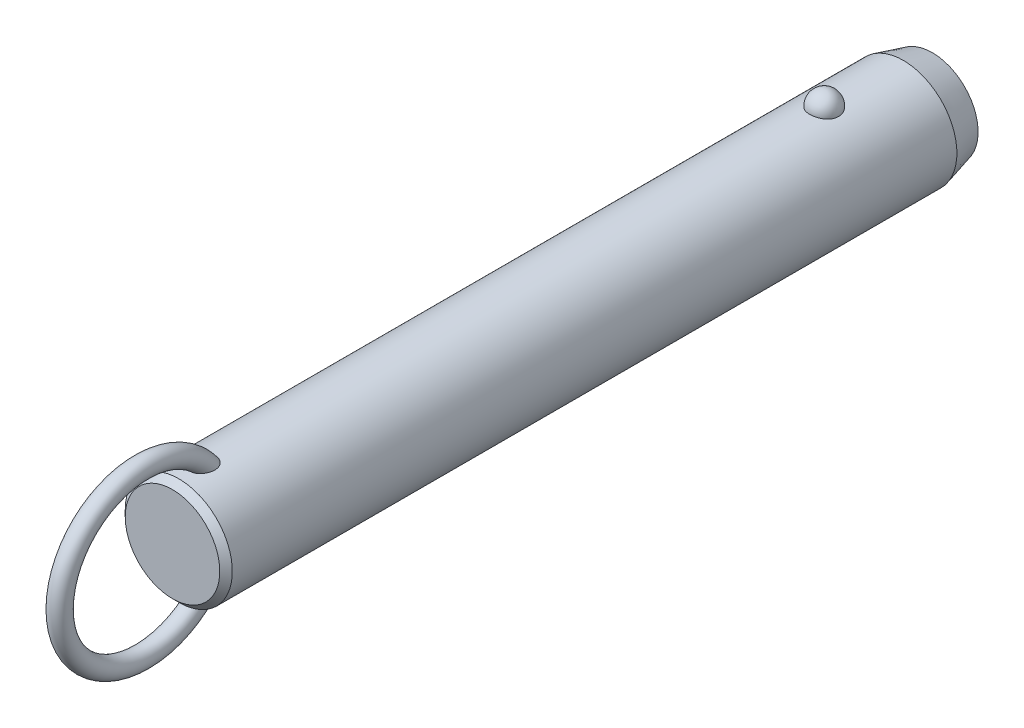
ISO-10303-21;
HEADER;
FILE_DESCRIPTION(('STEP AP214'),'2;1');
FILE_NAME('part.step','',(''),(''),'','','');
FILE_SCHEMA(('AUTOMOTIVE_DESIGN { 1 0 10303 214 1 1 1 1 }'));
ENDSEC;
DATA;
#1=APPLICATION_CONTEXT('core data for automotive mechanical design processes');
#2=APPLICATION_PROTOCOL_DEFINITION('international standard','automotive_design',2000,#1);
#3=PRODUCT_CONTEXT('',#1,'mechanical');
#4=PRODUCT('Part','Part','',(#3));
#5=PRODUCT_RELATED_PRODUCT_CATEGORY('part','',(#4));
#6=PRODUCT_DEFINITION_FORMATION('','',#4);
#7=PRODUCT_DEFINITION_CONTEXT('part definition',#1,'design');
#8=PRODUCT_DEFINITION('design','',#6,#7);
#9=PRODUCT_DEFINITION_SHAPE('','',#8);
#10=(LENGTH_UNIT() NAMED_UNIT(*) SI_UNIT(.MILLI.,.METRE.));
#11=(NAMED_UNIT(*) PLANE_ANGLE_UNIT() SI_UNIT($,.RADIAN.));
#12=(NAMED_UNIT(*) SI_UNIT($,.STERADIAN.) SOLID_ANGLE_UNIT());
#13=UNCERTAINTY_MEASURE_WITH_UNIT(LENGTH_MEASURE(1.E-05),#10,'distance_accuracy_value','');
#14=(GEOMETRIC_REPRESENTATION_CONTEXT(3) GLOBAL_UNCERTAINTY_ASSIGNED_CONTEXT((#13)) GLOBAL_UNIT_ASSIGNED_CONTEXT((#10,
#11,#12)) REPRESENTATION_CONTEXT('',''));
#15=CARTESIAN_POINT('',(0.,0.,0.));
#16=DIRECTION('',(0.,0.,1.));
#17=DIRECTION('',(1.,0.,0.));
#18=AXIS2_PLACEMENT_3D('',#15,#16,#17);
#19=CARTESIAN_POINT('',(0.,0.,119.4));
#20=DIRECTION('',(0.,0.,-1.));
#21=DIRECTION('',(-1.,0.,0.));
#22=AXIS2_PLACEMENT_3D('',#19,#20,#21);
#23=CYLINDRICAL_SURFACE('',#22,11.1);
#24=CARTESIAN_POINT('',(2.9724815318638,10.6945945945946,-3.));
#25=CARTESIAN_POINT('',(2.97247830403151,10.6945972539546,-2.83225059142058));
#26=CARTESIAN_POINT('',(2.95876598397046,10.6984356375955,-2.66445972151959));
#27=CARTESIAN_POINT('',(2.90424529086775,10.7133624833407,-2.33362381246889));
#28=CARTESIAN_POINT('',(2.8634252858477,10.7244540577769,-2.1705808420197));
#29=CARTESIAN_POINT('',(2.75573657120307,10.7526272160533,-1.85396767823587));
#30=CARTESIAN_POINT('',(2.68887937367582,10.7697061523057,-1.70039333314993));
#31=CARTESIAN_POINT('',(2.53079696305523,10.8079438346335,-1.40691598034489));
#32=CARTESIAN_POINT('',(2.43957264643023,10.8291024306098,-1.2670124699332));
#33=CARTESIAN_POINT('',(2.23458150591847,10.8732541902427,-1.00409565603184));
#34=CARTESIAN_POINT('',(2.12071295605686,10.8962553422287,-0.881162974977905));
#35=CARTESIAN_POINT('',(1.87365402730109,10.9414421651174,-0.656352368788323));
#36=CARTESIAN_POINT('',(1.74046358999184,10.9636278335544,-0.554474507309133));
#37=CARTESIAN_POINT('',(1.45872188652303,11.0046495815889,-0.374872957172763));
#38=CARTESIAN_POINT('',(1.31021276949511,11.0234944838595,-0.297085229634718));
#39=CARTESIAN_POINT('',(1.00170030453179,11.0557957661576,-0.167529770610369));
#40=CARTESIAN_POINT('',(0.841698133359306,11.0692526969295,-0.115759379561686));
#41=CARTESIAN_POINT('',(0.517607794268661,11.0890932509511,-0.0403925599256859));
#42=CARTESIAN_POINT('',(0.353633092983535,11.0955916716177,-0.0163383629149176));
#43=CARTESIAN_POINT('',(0.0238420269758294,11.1011989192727,0.0044517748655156));
#44=CARTESIAN_POINT('',(-0.141974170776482,11.1003084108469,0.00119017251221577));
#45=CARTESIAN_POINT('',(-0.468405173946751,11.0912990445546,-0.0323233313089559));
#46=CARTESIAN_POINT('',(-0.629059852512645,11.0832767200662,-0.0622147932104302));
#47=CARTESIAN_POINT('',(-0.942937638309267,11.0609962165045,-0.147645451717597));
#48=CARTESIAN_POINT('',(-1.09616062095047,11.0467379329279,-0.203185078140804));
#49=CARTESIAN_POINT('',(-1.39181061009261,11.0134071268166,-0.3387529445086));
#50=CARTESIAN_POINT('',(-1.53417383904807,10.9943086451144,-0.418913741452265));
#51=CARTESIAN_POINT('',(-1.80342160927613,10.9533667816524,-0.60144882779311));
#52=CARTESIAN_POINT('',(-1.9303046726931,10.9315231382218,-0.703825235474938));
#53=CARTESIAN_POINT('',(-2.16747598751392,10.887005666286,-0.930091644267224));
#54=CARTESIAN_POINT('',(-2.27742774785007,10.8643239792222,-1.05433291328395));
#55=CARTESIAN_POINT('',(-2.47517316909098,10.8209886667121,-1.31966633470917));
#56=CARTESIAN_POINT('',(-2.56296538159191,10.8003351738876,-1.46075958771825));
#57=CARTESIAN_POINT('',(-2.71500300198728,10.7631304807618,-1.75753646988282));
#58=CARTESIAN_POINT('',(-2.77898901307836,10.7466250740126,-1.91335887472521));
#59=CARTESIAN_POINT('',(-2.88046189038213,10.7198747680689,-2.2339152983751));
#60=CARTESIAN_POINT('',(-2.91794947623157,10.709629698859,-2.39864907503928));
#61=CARTESIAN_POINT('',(-2.96537819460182,10.6965949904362,-2.73165170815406));
#62=CARTESIAN_POINT('',(-2.97542891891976,10.693775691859,-2.89990378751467));
#63=CARTESIAN_POINT('',(-2.96804271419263,10.6958279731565,-3.235752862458));
#64=CARTESIAN_POINT('',(-2.95060646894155,10.7006993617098,-3.40334987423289));
#65=CARTESIAN_POINT('',(-2.88883358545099,10.71753912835,-3.73233906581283));
#66=CARTESIAN_POINT('',(-2.84462026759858,10.7294749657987,-3.89375610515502));
#67=CARTESIAN_POINT('',(-2.73050447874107,10.7590797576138,-4.20667949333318));
#68=CARTESIAN_POINT('',(-2.66060103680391,10.7767489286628,-4.35818546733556));
#69=CARTESIAN_POINT('',(-2.49642559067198,10.8159599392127,-4.6478542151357));
#70=CARTESIAN_POINT('',(-2.40203047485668,10.8375211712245,-4.78594458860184));
#71=CARTESIAN_POINT('',(-2.19143488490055,10.8820570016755,-5.0441038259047));
#72=CARTESIAN_POINT('',(-2.07523364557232,10.9050316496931,-5.16417205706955));
#73=CARTESIAN_POINT('',(-1.82361254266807,10.9499219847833,-5.38334833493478));
#74=CARTESIAN_POINT('',(-1.68812945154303,10.9718338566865,-5.48238464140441));
#75=CARTESIAN_POINT('',(-1.40191298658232,11.0120611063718,-5.65618873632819));
#76=CARTESIAN_POINT('',(-1.25118062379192,11.0303767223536,-5.73095813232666));
#77=CARTESIAN_POINT('',(-0.940570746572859,11.0611653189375,-5.85334725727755));
#78=CARTESIAN_POINT('',(-0.780821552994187,11.0737044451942,-5.90127578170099));
#79=CARTESIAN_POINT('',(-0.455204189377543,11.0918598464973,-5.96992976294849));
#80=CARTESIAN_POINT('',(-0.289336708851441,11.0974768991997,-5.99065827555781));
#81=CARTESIAN_POINT('',(0.0406846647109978,11.1011307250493,-6.00418773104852));
#82=CARTESIAN_POINT('',(0.204817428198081,11.099299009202,-5.99747318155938));
#83=CARTESIAN_POINT('',(0.5295530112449,11.088551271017,-5.9574031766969));
#84=CARTESIAN_POINT('',(0.69015594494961,11.0796354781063,-5.92404858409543));
#85=CARTESIAN_POINT('',(1.0027760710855,11.0557204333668,-5.83180084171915));
#86=CARTESIAN_POINT('',(1.15482001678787,11.0407414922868,-5.77299291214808));
#87=CARTESIAN_POINT('',(1.44678373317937,11.0062913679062,-5.63147366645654));
#88=CARTESIAN_POINT('',(1.58670279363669,10.9868199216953,-5.54876095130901));
#89=CARTESIAN_POINT('',(1.8527023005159,10.9451315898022,-5.36027644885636));
#90=CARTESIAN_POINT('',(1.97855158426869,10.9228788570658,-5.25418644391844));
#91=CARTESIAN_POINT('',(2.21080872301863,10.8782509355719,-5.02251354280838));
#92=CARTESIAN_POINT('',(2.31721312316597,10.8558757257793,-4.89692718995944));
#93=CARTESIAN_POINT('',(2.5094551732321,10.8130715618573,-4.62745408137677));
#94=CARTESIAN_POINT('',(2.59493284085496,10.7926798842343,-4.48330448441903));
#95=CARTESIAN_POINT('',(2.740862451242,10.7565495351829,-4.18236358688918));
#96=CARTESIAN_POINT('',(2.80132490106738,10.7408089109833,-4.02557762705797));
#97=CARTESIAN_POINT('',(2.88959070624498,10.7173718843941,-3.72475308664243));
#98=CARTESIAN_POINT('',(2.92062102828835,10.7088950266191,-3.58171216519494));
#99=CARTESIAN_POINT('',(2.96206765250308,10.6975052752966,-3.29245795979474));
#100=CARTESIAN_POINT('',(2.97248434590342,10.6945922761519,-3.14624473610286));
#101=CARTESIAN_POINT('',(2.9724815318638,10.6945945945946,-3.));
#102=B_SPLINE_CURVE_WITH_KNOTS('',3,(#24,#25,#26,#27,#28,#29,#30,#31,#32,#33,#34,#35,#36,#37,
#38,#39,#40,#41,#42,#43,#44,#45,#46,#47,#48,#49,#50,#51,#52,#53,#54,#55,#56,#57,#58,#59,#60,#61,
#62,#63,#64,#65,#66,#67,#68,#69,#70,#71,#72,#73,#74,#75,#76,#77,#78,#79,#80,#81,#82,#83,#84,#85,
#86,#87,#88,#89,#90,#91,#92,#93,#94,#95,#96,#97,#98,#99,#100,#101),.UNSPECIFIED.,.T.,.F.,(4,2,2,
2,2,2,2,2,2,2,2,2,2,2,2,2,2,2,2,2,2,2,2,2,2,2,2,2,2,2,2,2,2,2,2,2,2,2,4),(0.,0.502722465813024,
1.00566079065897,1.5083769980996,2.01107471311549,2.51608392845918,3.02109467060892,
3.52475118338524,4.02835620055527,4.523518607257,5.0186364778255,5.50715297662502,
5.9956776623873,6.48688002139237,6.97812923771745,7.47814366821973,7.9781907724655,
8.48353712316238,8.9888697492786,9.49218093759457,9.99547960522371,10.4964777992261,
10.997494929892,11.5010810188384,12.0046847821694,12.5099796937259,13.0152411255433,
13.5145635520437,14.0138298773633,14.5043200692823,14.9947943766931,15.4836390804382,
15.9725123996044,16.4685040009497,16.9645836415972,17.4686765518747,17.972557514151,
18.410841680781,18.849117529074),.UNSPECIFIED.);
#103=CARTESIAN_POINT('',(2.9724815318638,10.6945945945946,-3.));
#104=VERTEX_POINT('',#103);
#105=EDGE_CURVE('E41',#104,#104,#102,.T.);
#106=ORIENTED_EDGE('',*,*,#105,.T.);
#107=EDGE_LOOP('',(#106));
#108=FACE_BOUND('',#107,.T.);
#109=CARTESIAN_POINT('',(0.,0.,130.8));
#110=DIRECTION('',(0.,0.,1.));
#111=DIRECTION('',(1.,0.,0.));
#112=AXIS2_PLACEMENT_3D('',#109,#110,#111);
#113=CIRCLE('',#112,11.1);
#114=CARTESIAN_POINT('',(-11.1,0.,130.8));
#115=VERTEX_POINT('',#114);
#116=EDGE_CURVE('E10',#115,#115,#113,.F.);
#117=ORIENTED_EDGE('',*,*,#116,.T.);
#118=EDGE_LOOP('',(#117));
#119=FACE_BOUND('',#118,.T.);
#120=CARTESIAN_POINT('',(-0.564520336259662,-11.0856356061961,123.057815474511));
#121=CARTESIAN_POINT('',(-0.667202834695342,-11.0804062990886,123.091283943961));
#122=CARTESIAN_POINT('',(-0.766875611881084,-11.0738877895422,123.133835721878));
#123=CARTESIAN_POINT('',(-0.957284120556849,-11.0590576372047,123.235419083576));
#124=CARTESIAN_POINT('',(-1.04801616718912,-11.0507452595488,123.29445742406));
#125=CARTESIAN_POINT('',(-1.21800952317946,-11.0333016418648,123.426529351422));
#126=CARTESIAN_POINT('',(-1.29730805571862,-11.0241732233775,123.499515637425));
#127=CARTESIAN_POINT('',(-1.44337665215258,-11.0060026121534,123.657037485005));
#128=CARTESIAN_POINT('',(-1.51014622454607,-10.9969604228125,123.741573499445));
#129=CARTESIAN_POINT('',(-1.63454620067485,-10.9791841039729,123.925521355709));
#130=CARTESIAN_POINT('',(-1.69127003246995,-10.9705107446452,124.025549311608));
#131=CARTESIAN_POINT('',(-1.78980785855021,-10.9548648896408,124.232790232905));
#132=CARTESIAN_POINT('',(-1.83161214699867,-10.9478935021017,124.340007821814));
#133=CARTESIAN_POINT('',(-1.91557028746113,-10.9335803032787,124.605408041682));
#134=CARTESIAN_POINT('',(-1.95040620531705,-10.9273269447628,124.765980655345));
#135=CARTESIAN_POINT('',(-1.99388326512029,-10.9194709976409,125.090697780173));
#136=CARTESIAN_POINT('',(-2.00248051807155,-10.9178762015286,125.254847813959));
#137=CARTESIAN_POINT('',(-1.99551615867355,-10.9191578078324,125.624650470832));
#138=CARTESIAN_POINT('',(-1.9732206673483,-10.9232807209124,125.830191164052));
#139=CARTESIAN_POINT('',(-1.9152976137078,-10.9335244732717,126.133595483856));
#140=CARTESIAN_POINT('',(-1.89184575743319,-10.9376266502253,126.234088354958));
#141=CARTESIAN_POINT('',(-1.83700674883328,-10.9469720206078,126.432855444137));
#142=CARTESIAN_POINT('',(-1.80562070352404,-10.9522150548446,126.531129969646));
#143=CARTESIAN_POINT('',(-1.73463055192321,-10.9636837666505,126.725914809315));
#144=CARTESIAN_POINT('',(-1.69493416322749,-10.9699202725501,126.822390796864));
#145=CARTESIAN_POINT('',(-1.60745141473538,-10.9830806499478,127.011626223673));
#146=CARTESIAN_POINT('',(-1.55966150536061,-10.9900048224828,127.104384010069));
#147=CARTESIAN_POINT('',(-1.45591812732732,-11.0042280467,127.284690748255));
#148=CARTESIAN_POINT('',(-1.40000013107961,-11.0115253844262,127.372260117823));
#149=CARTESIAN_POINT('',(-1.27937470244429,-11.0261911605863,127.541029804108));
#150=CARTESIAN_POINT('',(-1.21467835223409,-11.0335594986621,127.62223795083));
#151=CARTESIAN_POINT('',(-1.08218150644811,-11.0473027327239,127.769001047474));
#152=CARTESIAN_POINT('',(-1.01522633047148,-11.0537063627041,127.835309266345));
#153=CARTESIAN_POINT('',(-0.872952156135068,-11.065850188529,127.958378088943));
#154=CARTESIAN_POINT('',(-0.797642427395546,-11.0715911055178,128.015149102));
#155=CARTESIAN_POINT('',(-0.651396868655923,-11.081071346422,128.107515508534));
#156=CARTESIAN_POINT('',(-0.581712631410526,-11.0849841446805,128.145049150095));
#157=CARTESIAN_POINT('',(-0.437066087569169,-11.0916271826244,128.208259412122));
#158=CARTESIAN_POINT('',(-0.362109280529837,-11.0943586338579,128.233948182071));
#159=CARTESIAN_POINT('',(-0.207828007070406,-11.0983242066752,128.271117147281));
#160=CARTESIAN_POINT('',(-0.128467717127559,-11.0995432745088,128.282454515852));
#161=CARTESIAN_POINT('',(0.0309101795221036,-11.1002423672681,128.288965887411));
#162=CARTESIAN_POINT('',(0.110927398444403,-11.0997233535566,128.284148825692));
#163=CARTESIAN_POINT('',(0.256406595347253,-11.097240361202,128.260959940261));
#164=CARTESIAN_POINT('',(0.322235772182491,-11.0955074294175,128.244754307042));
#165=CARTESIAN_POINT('',(0.450635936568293,-11.0910350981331,128.202600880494));
#166=CARTESIAN_POINT('',(0.513205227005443,-11.0882951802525,128.176648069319));
#167=CARTESIAN_POINT('',(0.662626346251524,-11.0805620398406,128.102607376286));
#168=CARTESIAN_POINT('',(0.747127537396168,-11.0751144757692,128.049845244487));
#169=CARTESIAN_POINT('',(0.906756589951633,-11.0631932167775,127.931720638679));
#170=CARTESIAN_POINT('',(0.981859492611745,-11.0567168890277,127.866325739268));
#171=CARTESIAN_POINT('',(1.10712207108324,-11.0447856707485,127.74226337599));
#172=CARTESIAN_POINT('',(1.15909566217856,-11.0394280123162,127.685383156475));
#173=CARTESIAN_POINT('',(1.25791923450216,-11.0286040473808,127.567327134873));
#174=CARTESIAN_POINT('',(1.30476642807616,-11.0231376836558,127.506149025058));
#175=CARTESIAN_POINT('',(1.43818612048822,-11.0068027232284,127.317305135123));
#176=CARTESIAN_POINT('',(1.51751767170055,-10.9960104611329,127.184453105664));
#177=CARTESIAN_POINT('',(1.63597546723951,-10.9788847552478,126.953137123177));
#178=CARTESIAN_POINT('',(1.67988876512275,-10.9722190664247,126.857053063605));
#179=CARTESIAN_POINT('',(1.7595324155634,-10.9597298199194,126.661431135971));
#180=CARTESIAN_POINT('',(1.79525967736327,-10.9539065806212,126.561891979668));
#181=CARTESIAN_POINT('',(1.8584473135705,-10.9433632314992,126.36021118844));
#182=CARTESIAN_POINT('',(1.88591073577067,-10.9386427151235,126.258070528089));
#183=CARTESIAN_POINT('',(1.93234324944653,-10.9305350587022,126.051819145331));
#184=CARTESIAN_POINT('',(1.95131065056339,-10.9271481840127,125.947708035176));
#185=CARTESIAN_POINT('',(1.99040203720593,-10.9201183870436,125.665458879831));
#186=CARTESIAN_POINT('',(2.00221217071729,-10.9179256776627,125.486037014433));
#187=CARTESIAN_POINT('',(1.99711676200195,-10.9188636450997,125.127713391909));
#188=CARTESIAN_POINT('',(1.98026150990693,-10.9219849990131,124.948811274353));
#189=CARTESIAN_POINT('',(1.92151657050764,-10.9324473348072,124.63645144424));
#190=CARTESIAN_POINT('',(1.88605081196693,-10.9386915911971,124.501759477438));
#191=CARTESIAN_POINT('',(1.79393020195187,-10.9541780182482,124.239966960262));
#192=CARTESIAN_POINT('',(1.73729868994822,-10.9634168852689,124.112858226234));
#193=CARTESIAN_POINT('',(1.61237037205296,-10.9824218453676,123.889418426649));
#194=CARTESIAN_POINT('',(1.54715374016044,-10.9918945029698,123.791345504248));
#195=CARTESIAN_POINT('',(1.40127026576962,-11.0114415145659,123.607434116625));
#196=CARTESIAN_POINT('',(1.3206074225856,-11.0215157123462,123.521592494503));
#197=CARTESIAN_POINT('',(1.1447478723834,-11.041168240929,123.365163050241));
#198=CARTESIAN_POINT('',(1.0494780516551,-11.0507437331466,123.294656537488));
#199=CARTESIAN_POINT('',(0.847278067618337,-11.0680789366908,123.172640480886));
#200=CARTESIAN_POINT('',(0.740351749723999,-11.0758392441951,123.121124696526));
#201=CARTESIAN_POINT('',(0.529289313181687,-11.0878275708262,123.043485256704));
#202=CARTESIAN_POINT('',(0.425895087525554,-11.0923259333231,123.015377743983));
#203=CARTESIAN_POINT('',(0.215723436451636,-11.0984001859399,122.977703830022));
#204=CARTESIAN_POINT('',(0.108947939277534,-11.0999777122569,122.968127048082));
#205=CARTESIAN_POINT('',(-0.0938962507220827,-11.1000196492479,122.967877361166));
#206=CARTESIAN_POINT('',(-0.189967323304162,-11.0987797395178,122.975408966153));
#207=CARTESIAN_POINT('',(-0.3796579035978,-11.0939111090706,123.005507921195));
#208=CARTESIAN_POINT('',(-0.473277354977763,-11.0902823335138,123.028075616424));
#209=CARTESIAN_POINT('',(-0.564520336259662,-11.0856356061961,123.057815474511));
#210=B_SPLINE_CURVE_WITH_KNOTS('',3,(#120,#121,#122,#123,#124,#125,#126,#127,#128,#129,#130,
#131,#132,#133,#134,#135,#136,#137,#138,#139,#140,#141,#142,#143,#144,#145,#146,#147,#148,#149,
#150,#151,#152,#153,#154,#155,#156,#157,#158,#159,#160,#161,#162,#163,#164,#165,#166,#167,#168,
#169,#170,#171,#172,#173,#174,#175,#176,#177,#178,#179,#180,#181,#182,#183,#184,#185,#186,#187,
#188,#189,#190,#191,#192,#193,#194,#195,#196,#197,#198,#199,#200,#201,#202,#203,#204,#205,#206,
#207,#208,#209),.UNSPECIFIED.,.T.,.F.,(4,2,2,2,2,2,2,2,2,2,2,2,2,2,2,2,2,2,2,2,2,2,2,2,2,2,2,2,
2,2,2,2,2,2,2,2,2,2,2,2,2,2,2,2,4),(0.,0.323999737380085,0.648132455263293,0.971184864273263,
1.2942499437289,1.6388623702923,1.98369857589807,2.4742605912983,2.96564271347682,
3.58257396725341,3.89215258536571,4.20168803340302,4.51486273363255,4.82817514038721,
5.14015911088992,5.4517528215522,5.73442856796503,6.01679375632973,6.25364580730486,
6.49025437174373,6.72919963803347,6.96801276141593,7.17061258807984,7.37331685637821,
7.67094989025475,7.96935728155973,8.20075067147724,8.43226927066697,8.89581623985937,
9.21306533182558,9.53043400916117,9.84768549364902,10.1650000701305,10.7022930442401,
11.2386443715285,11.6553390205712,12.0715755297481,12.4245637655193,12.7774607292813,
13.1321855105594,13.4867936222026,13.8068771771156,14.1267813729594,14.4146787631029,
14.7025827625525),.UNSPECIFIED.);
#211=CARTESIAN_POINT('',(-0.564520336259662,-11.0856356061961,123.057815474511));
#212=VERTEX_POINT('',#211);
#213=EDGE_CURVE('E59',#212,#212,#210,.T.);
#214=ORIENTED_EDGE('',*,*,#213,.T.);
#215=EDGE_LOOP('',(#214));
#216=FACE_BOUND('',#215,.T.);
#217=CARTESIAN_POINT('',(-0.564520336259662,11.0856356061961,123.057815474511));
#218=CARTESIAN_POINT('',(-0.468542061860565,11.0905203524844,123.026545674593));
#219=CARTESIAN_POINT('',(-0.369793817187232,11.0942886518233,123.003157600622));
#220=CARTESIAN_POINT('',(-0.169555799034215,11.0991586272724,122.973085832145));
#221=CARTESIAN_POINT('',(-0.0680604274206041,11.1002543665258,122.96643932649));
#222=CARTESIAN_POINT('',(0.134549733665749,11.099646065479,122.970157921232));
#223=CARTESIAN_POINT('',(0.235664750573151,11.0979441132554,122.98051033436));
#224=CARTESIAN_POINT('',(0.434632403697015,11.0919342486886,123.017831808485));
#225=CARTESIAN_POINT('',(0.532486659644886,11.0876276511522,123.044792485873));
#226=CARTESIAN_POINT('',(0.722445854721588,11.0768742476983,123.1144096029));
#227=CARTESIAN_POINT('',(0.814543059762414,11.0704246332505,123.157086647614));
#228=CARTESIAN_POINT('',(0.990565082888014,11.0560659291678,123.256648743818));
#229=CARTESIAN_POINT('',(1.07448844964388,11.048156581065,123.313536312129));
#230=CARTESIAN_POINT('',(1.23562672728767,11.0313221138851,123.442210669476));
#231=CARTESIAN_POINT('',(1.3124268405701,11.0223686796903,123.514511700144));
#232=CARTESIAN_POINT('',(1.45398030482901,11.0045918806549,123.670042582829));
#233=CARTESIAN_POINT('',(1.5187307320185,10.9957685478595,123.753275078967));
#234=CARTESIAN_POINT('',(1.64107232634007,10.9782087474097,123.936384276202));
#235=CARTESIAN_POINT('',(1.69743176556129,10.9695572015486,124.037089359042));
#236=CARTESIAN_POINT('',(1.79515063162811,10.9539887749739,124.245626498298));
#237=CARTESIAN_POINT('',(1.83649966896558,10.9470730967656,124.35346343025));
#238=CARTESIAN_POINT('',(1.91931148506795,10.9329211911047,124.620399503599));
#239=CARTESIAN_POINT('',(1.95340104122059,10.9267904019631,124.781861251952));
#240=CARTESIAN_POINT('',(1.99526195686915,10.9192174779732,125.10821631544));
#241=CARTESIAN_POINT('',(2.00298989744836,10.9177830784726,125.27311484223));
#242=CARTESIAN_POINT('',(1.99396251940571,10.9194420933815,125.644100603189));
#243=CARTESIAN_POINT('',(1.97050829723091,10.923774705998,125.85003871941));
#244=CARTESIAN_POINT('',(1.91079643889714,10.9343131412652,126.153901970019));
#245=CARTESIAN_POINT('',(1.88673702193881,10.9385106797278,126.254529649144));
#246=CARTESIAN_POINT('',(1.83065508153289,10.9480376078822,126.453510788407));
#247=CARTESIAN_POINT('',(1.79863369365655,10.9533668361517,126.551864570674));
#248=CARTESIAN_POINT('',(1.72633365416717,10.9649954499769,126.746720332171));
#249=CARTESIAN_POINT('',(1.68596409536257,10.9713053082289,126.84318790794));
#250=CARTESIAN_POINT('',(1.59707998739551,10.9845964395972,127.032323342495));
#251=CARTESIAN_POINT('',(1.54856169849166,10.9915780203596,127.124989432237));
#252=CARTESIAN_POINT('',(1.44330168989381,11.0058935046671,127.304975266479));
#253=CARTESIAN_POINT('',(1.3865974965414,11.0132257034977,127.392316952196));
#254=CARTESIAN_POINT('',(1.26431158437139,11.0279330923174,127.560456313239));
#255=CARTESIAN_POINT('',(1.19874160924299,11.0353082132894,127.641262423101));
#256=CARTESIAN_POINT('',(1.06542088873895,11.048931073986,127.785985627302));
#257=CARTESIAN_POINT('',(0.998640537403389,11.0552153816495,127.850784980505));
#258=CARTESIAN_POINT('',(0.85689668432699,11.0671032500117,127.970846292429));
#259=CARTESIAN_POINT('',(0.781942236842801,11.0727075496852,128.026118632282));
#260=CARTESIAN_POINT('',(0.636276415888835,11.081949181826,128.115972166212));
#261=CARTESIAN_POINT('',(0.566755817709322,11.0857572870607,128.152441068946));
#262=CARTESIAN_POINT('',(0.422602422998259,11.0921860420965,128.213533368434));
#263=CARTESIAN_POINT('',(0.347974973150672,11.0948079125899,128.238168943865));
#264=CARTESIAN_POINT('',(0.19459385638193,11.0985608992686,128.273323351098));
#265=CARTESIAN_POINT('',(0.115807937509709,11.0996777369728,128.283706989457));
#266=CARTESIAN_POINT('',(-0.0422499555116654,11.1002003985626,128.288574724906));
#267=CARTESIAN_POINT('',(-0.12152169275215,11.09960699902,128.283066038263));
#268=CARTESIAN_POINT('',(-0.266046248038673,11.0970123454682,128.258827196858));
#269=CARTESIAN_POINT('',(-0.331661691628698,11.0952283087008,128.242135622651));
#270=CARTESIAN_POINT('',(-0.459588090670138,11.0906663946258,128.199111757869));
#271=CARTESIAN_POINT('',(-0.521897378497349,11.0878880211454,128.172774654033));
#272=CARTESIAN_POINT('',(-0.671446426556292,11.0800342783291,128.097513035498));
#273=CARTESIAN_POINT('',(-0.756250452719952,11.0744969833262,128.043818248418));
#274=CARTESIAN_POINT('',(-0.916349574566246,11.0624045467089,127.923802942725));
#275=CARTESIAN_POINT('',(-0.991618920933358,11.0558467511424,127.857449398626));
#276=CARTESIAN_POINT('',(-1.11713140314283,11.0437783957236,127.731633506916));
#277=CARTESIAN_POINT('',(-1.16920539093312,11.0383619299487,127.673952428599));
#278=CARTESIAN_POINT('',(-1.26817476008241,11.02743010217,127.554280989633));
#279=CARTESIAN_POINT('',(-1.31506731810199,11.0219146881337,127.492288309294));
#280=CARTESIAN_POINT('',(-1.40399813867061,11.0109399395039,127.364784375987));
#281=CARTESIAN_POINT('',(-1.44602864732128,11.0054807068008,127.299267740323));
#282=CARTESIAN_POINT('',(-1.52538779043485,10.9947621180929,127.165422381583));
#283=CARTESIAN_POINT('',(-1.56271516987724,10.9895028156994,127.097092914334));
#284=CARTESIAN_POINT('',(-1.645379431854,10.9774790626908,126.933210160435));
#285=CARTESIAN_POINT('',(-1.68879497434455,10.9708503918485,126.8366735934));
#286=CARTESIAN_POINT('',(-1.7674073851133,10.9584602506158,126.640236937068));
#287=CARTESIAN_POINT('',(-1.80260120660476,10.95269910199,126.54033561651));
#288=CARTESIAN_POINT('',(-1.86468657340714,10.9423003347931,126.337966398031));
#289=CARTESIAN_POINT('',(-1.8915816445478,10.9376622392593,126.235499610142));
#290=CARTESIAN_POINT('',(-1.93682458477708,10.9297405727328,126.028642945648));
#291=CARTESIAN_POINT('',(-1.95517082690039,10.9264572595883,125.924252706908));
#292=CARTESIAN_POINT('',(-1.99232562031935,10.9197647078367,125.64262876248));
#293=CARTESIAN_POINT('',(-2.00294603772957,10.9177914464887,125.464185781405));
#294=CARTESIAN_POINT('',(-1.99566675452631,10.9191290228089,125.107996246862));
#295=CARTESIAN_POINT('',(-1.97781651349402,10.9224306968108,124.93024902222));
#296=CARTESIAN_POINT('',(-1.91747214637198,10.9331592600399,124.619792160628));
#297=CARTESIAN_POINT('',(-1.88131022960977,10.9395108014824,124.485825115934));
#298=CARTESIAN_POINT('',(-1.7879038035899,10.9551659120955,124.22559757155));
#299=CARTESIAN_POINT('',(-1.7306830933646,10.9644661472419,124.099328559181));
#300=CARTESIAN_POINT('',(-1.60475573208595,10.9835398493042,123.87741565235));
#301=CARTESIAN_POINT('',(-1.53908879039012,10.9930297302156,123.780026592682));
#302=CARTESIAN_POINT('',(-1.39238608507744,11.0125708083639,123.597525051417));
#303=CARTESIAN_POINT('',(-1.31135150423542,11.0226219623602,123.512411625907));
#304=CARTESIAN_POINT('',(-1.14382035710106,11.0411991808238,123.36529943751));
#305=CARTESIAN_POINT('',(-1.05858500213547,11.0497792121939,123.30186930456));
#306=CARTESIAN_POINT('',(-0.878723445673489,11.0655285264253,123.190250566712));
#307=CARTESIAN_POINT('',(-0.784123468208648,11.0727015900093,123.142020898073));
#308=CARTESIAN_POINT('',(-0.646163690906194,11.0812501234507,123.086023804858));
#309=CARTESIAN_POINT('',(-0.605595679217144,11.0835451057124,123.071197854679));
#310=CARTESIAN_POINT('',(-0.564520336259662,11.0856356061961,123.057815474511));
#311=B_SPLINE_CURVE_WITH_KNOTS('',3,(#217,#218,#219,#220,#221,#222,#223,#224,#225,#226,#227,
#228,#229,#230,#231,#232,#233,#234,#235,#236,#237,#238,#239,#240,#241,#242,#243,#244,#245,#246,
#247,#248,#249,#250,#251,#252,#253,#254,#255,#256,#257,#258,#259,#260,#261,#262,#263,#264,#265,
#266,#267,#268,#269,#270,#271,#272,#273,#274,#275,#276,#277,#278,#279,#280,#281,#282,#283,#284,
#285,#286,#287,#288,#289,#290,#291,#292,#293,#294,#295,#296,#297,#298,#299,#300,#301,#302,#303,
#304,#305,#306,#307,#308,#309,#310),.UNSPECIFIED.,.T.,.F.,(4,2,2,2,2,2,2,2,2,2,2,2,2,2,2,2,2,2,
2,2,2,2,2,2,2,2,2,2,2,2,2,2,2,2,2,2,2,2,2,2,2,2,2,2,2,2,4),(0.,0.303061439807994,
0.606795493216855,0.910302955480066,1.21365733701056,1.51741085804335,1.82121821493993,
2.13745205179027,2.45376252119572,2.79958678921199,3.14564996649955,3.63832391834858,
4.13180893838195,4.75031912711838,5.06071926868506,5.37107516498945,5.68500772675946,
5.99908475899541,6.31176519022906,6.62403542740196,6.90315673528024,7.18197194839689,
7.41687778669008,7.6515413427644,7.8884158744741,8.12518286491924,8.32752842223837,
8.52997509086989,8.82986421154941,9.13054668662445,9.36393502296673,9.5974499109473,
9.83133221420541,10.0652767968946,10.3830324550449,10.7009056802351,11.0186436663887,
11.3364420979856,11.8705925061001,12.4038159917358,12.8189662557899,13.2336487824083,
13.5857049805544,13.9377340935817,14.2561354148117,14.5736690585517,14.7033687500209),.UNSPECIFIED.);
#312=CARTESIAN_POINT('',(-0.564520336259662,11.0856356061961,123.057815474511));
#313=VERTEX_POINT('',#312);
#314=EDGE_CURVE('E67',#313,#313,#311,.T.);
#315=ORIENTED_EDGE('',*,*,#314,.T.);
#316=EDGE_LOOP('',(#315));
#317=FACE_BOUND('',#316,.T.);
#318=CARTESIAN_POINT('',(0.,0.,-19.3999999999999));
#319=DIRECTION('',(0.,0.,-1.));
#320=DIRECTION('',(-1.,0.,0.));
#321=AXIS2_PLACEMENT_3D('',#318,#319,#320);
#322=CIRCLE('',#321,11.1);
#323=CARTESIAN_POINT('',(-11.1,0.,-19.3999999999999));
#324=VERTEX_POINT('',#323);
#325=EDGE_CURVE('E56',#324,#324,#322,.F.);
#326=ORIENTED_EDGE('',*,*,#325,.T.);
#327=EDGE_LOOP('',(#326));
#328=FACE_BOUND('',#327,.T.);
#329=ADVANCED_FACE('F37',(#108,#119,#216,#317,#328),#23,.T.);
#330=CARTESIAN_POINT('',(0.,0.,-25.4));
#331=DIRECTION('',(0.,0.,-1.));
#332=DIRECTION('',(-1.,0.,0.));
#333=AXIS2_PLACEMENT_3D('',#330,#331,#332);
#334=PLANE('',#333);
#335=CARTESIAN_POINT('',(0.,0.,-25.4));
#336=DIRECTION('',(0.,0.,-1.));
#337=DIRECTION('',(-1.,0.,0.));
#338=AXIS2_PLACEMENT_3D('',#335,#336,#337);
#339=CIRCLE('',#338,9.49230484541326);
#340=CARTESIAN_POINT('',(-9.49230484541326,0.,-25.4));
#341=VERTEX_POINT('',#340);
#342=EDGE_CURVE('E66',#341,#341,#339,.T.);
#343=ORIENTED_EDGE('',*,*,#342,.T.);
#344=EDGE_LOOP('',(#343));
#345=FACE_BOUND('',#344,.T.);
#346=ADVANCED_FACE('F85',(#345),#334,.T.);
#347=CARTESIAN_POINT('',(0.,0.,-25.4));
#348=DIRECTION('',(0.,0.,1.));
#349=DIRECTION('',(1.,0.,0.));
#350=AXIS2_PLACEMENT_3D('',#347,#348,#349);
#351=CONICAL_SURFACE('',#350,9.49230484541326,0.261799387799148);
#352=ORIENTED_EDGE('',*,*,#325,.F.);
#353=EDGE_LOOP('',(#352));
#354=FACE_BOUND('',#353,.T.);
#355=ORIENTED_EDGE('',*,*,#342,.F.);
#356=EDGE_LOOP('',(#355));
#357=FACE_BOUND('',#356,.T.);
#358=ADVANCED_FACE('F83',(#354,#357),#351,.T.);
#359=CARTESIAN_POINT('',(0.,0.,132.1));
#360=DIRECTION('',(0.,0.,1.));
#361=DIRECTION('',(1.,0.,0.));
#362=AXIS2_PLACEMENT_3D('',#359,#360,#361);
#363=PLANE('',#362);
#364=CARTESIAN_POINT('',(0.,0.,132.1));
#365=DIRECTION('',(0.,0.,1.));
#366=DIRECTION('',(1.,0.,0.));
#367=AXIS2_PLACEMENT_3D('',#364,#365,#366);
#368=CIRCLE('',#367,9.8);
#369=CARTESIAN_POINT('',(-9.80000000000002,0.,132.1));
#370=VERTEX_POINT('',#369);
#371=EDGE_CURVE('E50',#370,#370,#368,.T.);
#372=ORIENTED_EDGE('',*,*,#371,.T.);
#373=EDGE_LOOP('',(#372));
#374=FACE_BOUND('',#373,.T.);
#375=ADVANCED_FACE('F77',(#374),#363,.T.);
#376=CARTESIAN_POINT('',(0.,0.,138.45));
#377=DIRECTION('',(1.,0.,0.));
#378=DIRECTION('',(0.,0.,-1.));
#379=AXIS2_PLACEMENT_3D('',#376,#377,#378);
#380=TOROIDAL_SURFACE('',#379,17.05,2.);
#381=ORIENTED_EDGE('',*,*,#314,.F.);
#382=EDGE_LOOP('',(#381));
#383=FACE_BOUND('',#382,.T.);
#384=ORIENTED_EDGE('',*,*,#213,.F.);
#385=EDGE_LOOP('',(#384));
#386=FACE_BOUND('',#385,.T.);
#387=ADVANCED_FACE('F73',(#383,#386),#380,.T.);
#388=CARTESIAN_POINT('',(0.,0.,132.1));
#389=DIRECTION('',(0.,0.,-1.));
#390=DIRECTION('',(-1.,0.,0.));
#391=AXIS2_PLACEMENT_3D('',#388,#389,#390);
#392=CONICAL_SURFACE('',#391,9.8,0.785398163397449);
#393=CARTESIAN_POINT('',(-11.1,0.,130.8));
#394=CARTESIAN_POINT('',(-11.0864583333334,0.,130.813541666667));
#395=CARTESIAN_POINT('',(-11.0729166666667,0.,130.827083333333));
#396=CARTESIAN_POINT('',(-11.0458333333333,0.,130.854166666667));
#397=CARTESIAN_POINT('',(-11.0322916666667,0.,130.867708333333));
#398=CARTESIAN_POINT('',(-11.0052083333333,0.,130.894791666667));
#399=CARTESIAN_POINT('',(-10.9916666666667,0.,130.908333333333));
#400=CARTESIAN_POINT('',(-10.9645833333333,0.,130.935416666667));
#401=CARTESIAN_POINT('',(-10.9510416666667,0.,130.948958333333));
#402=CARTESIAN_POINT('',(-10.9239583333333,0.,130.976041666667));
#403=CARTESIAN_POINT('',(-10.9104166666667,0.,130.989583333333));
#404=CARTESIAN_POINT('',(-10.8833333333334,0.,131.016666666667));
#405=CARTESIAN_POINT('',(-10.8697916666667,0.,131.030208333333));
#406=CARTESIAN_POINT('',(-10.8427083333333,0.,131.057291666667));
#407=CARTESIAN_POINT('',(-10.8291666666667,0.,131.070833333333));
#408=CARTESIAN_POINT('',(-10.8020833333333,0.,131.097916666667));
#409=CARTESIAN_POINT('',(-10.7885416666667,0.,131.111458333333));
#410=CARTESIAN_POINT('',(-10.7614583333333,0.,131.138541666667));
#411=CARTESIAN_POINT('',(-10.7479166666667,0.,131.152083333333));
#412=CARTESIAN_POINT('',(-10.7208333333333,0.,131.179166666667));
#413=CARTESIAN_POINT('',(-10.7072916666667,0.,131.192708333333));
#414=CARTESIAN_POINT('',(-10.6802083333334,0.,131.219791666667));
#415=CARTESIAN_POINT('',(-10.6666666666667,0.,131.233333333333));
#416=CARTESIAN_POINT('',(-10.6395833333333,0.,131.260416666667));
#417=CARTESIAN_POINT('',(-10.6260416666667,0.,131.273958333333));
#418=CARTESIAN_POINT('',(-10.5989583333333,0.,131.301041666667));
#419=CARTESIAN_POINT('',(-10.5854166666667,0.,131.314583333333));
#420=CARTESIAN_POINT('',(-10.5583333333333,0.,131.341666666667));
#421=CARTESIAN_POINT('',(-10.5447916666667,0.,131.355208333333));
#422=CARTESIAN_POINT('',(-10.5177083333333,0.,131.382291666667));
#423=CARTESIAN_POINT('',(-10.5041666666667,0.,131.395833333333));
#424=CARTESIAN_POINT('',(-10.4770833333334,0.,131.422916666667));
#425=CARTESIAN_POINT('',(-10.4635416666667,0.,131.436458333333));
#426=CARTESIAN_POINT('',(-10.4364583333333,0.,131.463541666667));
#427=CARTESIAN_POINT('',(-10.4229166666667,0.,131.477083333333));
#428=CARTESIAN_POINT('',(-10.3958333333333,0.,131.504166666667));
#429=CARTESIAN_POINT('',(-10.3822916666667,0.,131.517708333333));
#430=CARTESIAN_POINT('',(-10.3552083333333,0.,131.544791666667));
#431=CARTESIAN_POINT('',(-10.3416666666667,0.,131.558333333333));
#432=CARTESIAN_POINT('',(-10.3145833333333,0.,131.585416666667));
#433=CARTESIAN_POINT('',(-10.3010416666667,0.,131.598958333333));
#434=CARTESIAN_POINT('',(-10.2739583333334,0.,131.626041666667));
#435=CARTESIAN_POINT('',(-10.2604166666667,0.,131.639583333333));
#436=CARTESIAN_POINT('',(-10.2333333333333,0.,131.666666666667));
#437=CARTESIAN_POINT('',(-10.2197916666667,0.,131.680208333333));
#438=CARTESIAN_POINT('',(-10.1927083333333,0.,131.707291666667));
#439=CARTESIAN_POINT('',(-10.1791666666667,0.,131.720833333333));
#440=CARTESIAN_POINT('',(-10.1520833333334,0.,131.747916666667));
#441=CARTESIAN_POINT('',(-10.1385416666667,0.,131.761458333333));
#442=CARTESIAN_POINT('',(-10.1114583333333,0.,131.788541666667));
#443=CARTESIAN_POINT('',(-10.0979166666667,0.,131.802083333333));
#444=CARTESIAN_POINT('',(-10.0708333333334,0.,131.829166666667));
#445=CARTESIAN_POINT('',(-10.0572916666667,0.,131.842708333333));
#446=CARTESIAN_POINT('',(-10.0302083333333,0.,131.869791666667));
#447=CARTESIAN_POINT('',(-10.0166666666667,0.,131.883333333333));
#448=CARTESIAN_POINT('',(-9.98958333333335,0.,131.910416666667));
#449=CARTESIAN_POINT('',(-9.97604166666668,0.,131.923958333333));
#450=CARTESIAN_POINT('',(-9.94895833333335,0.,131.951041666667));
#451=CARTESIAN_POINT('',(-9.93541666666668,0.,131.964583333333));
#452=CARTESIAN_POINT('',(-9.90833333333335,0.,131.991666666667));
#453=CARTESIAN_POINT('',(-9.89479166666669,0.,132.005208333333));
#454=CARTESIAN_POINT('',(-9.86770833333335,0.,132.032291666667));
#455=CARTESIAN_POINT('',(-9.85416666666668,0.,132.045833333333));
#456=CARTESIAN_POINT('',(-9.82708333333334,0.,132.072916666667));
#457=CARTESIAN_POINT('',(-9.81354166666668,0.,132.086458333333));
#458=CARTESIAN_POINT('',(-9.80000000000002,0.,132.1));
#459=B_SPLINE_CURVE_WITH_KNOTS('',3,(#393,#394,#395,#396,#397,#398,#399,#400,#401,#402,#403,
#404,#405,#406,#407,#408,#409,#410,#411,#412,#413,#414,#415,#416,#417,#418,#419,#420,#421,#422,
#423,#424,#425,#426,#427,#428,#429,#430,#431,#432,#433,#434,#435,#436,#437,#438,#439,#440,#441,
#442,#443,#444,#445,#446,#447,#448,#449,#450,#451,#452,#453,#454,#455,#456,#457,#458),
.UNSPECIFIED.,.F.,.F.,(4,2,2,2,2,2,2,2,2,2,2,2,2,2,2,2,2,2,2,2,2,2,2,2,2,2,2,2,2,2,2,2,4),(0.,
0.0574524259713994,0.114904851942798,0.172357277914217,0.229809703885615,0.287262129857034,
0.344714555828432,0.402166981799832,0.459619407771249,0.517071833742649,0.574524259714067,
0.631976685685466,0.689429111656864,0.746881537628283,0.804333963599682,0.861786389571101,
0.9192388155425,0.976691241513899,1.03414366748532,1.09159609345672,1.14904851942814,
1.20650094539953,1.26395337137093,1.32140579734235,1.37885822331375,1.43631064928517,
1.49376307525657,1.55121550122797,1.60866792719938,1.66612035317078,1.7235727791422,
1.7810252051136,1.83847763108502),.UNSPECIFIED.);
#460=EDGE_CURVE('BSEAM39',#115,#370,#459,.T.);
#461=ORIENTED_EDGE('',*,*,#116,.F.);
#462=ORIENTED_EDGE('',*,*,#371,.F.);
#463=ORIENTED_EDGE('',*,*,#460,.T.);
#464=ORIENTED_EDGE('',*,*,#460,.F.);
#465=EDGE_LOOP('',(#461,#463,#462,#464));
#466=FACE_BOUND('',#465,.T.);
#467=ADVANCED_FACE('F39',(#466),#392,.T.);
#468=CARTESIAN_POINT('',(0.,11.1,-3.));
#469=DIRECTION('',(0.,1.,0.));
#470=DIRECTION('',(0.,0.,-1.));
#471=AXIS2_PLACEMENT_3D('',#468,#469,#470);
#472=SPHERICAL_SURFACE('',#471,3.);
#473=ORIENTED_EDGE('',*,*,#105,.F.);
#474=EDGE_LOOP('',(#473));
#475=FACE_BOUND('',#474,.T.);
#476=ADVANCED_FACE('F79',(#475),#472,.T.);
#477=CLOSED_SHELL('',(#329,#346,#358,#375,#387,#467,#476));
#478=MANIFOLD_SOLID_BREP('B2',#477);
#479=ADVANCED_BREP_SHAPE_REPRESENTATION('',(#18,#478),#14);
#480=SHAPE_DEFINITION_REPRESENTATION(#9,#479);
ENDSEC;
END-ISO-10303-21;
